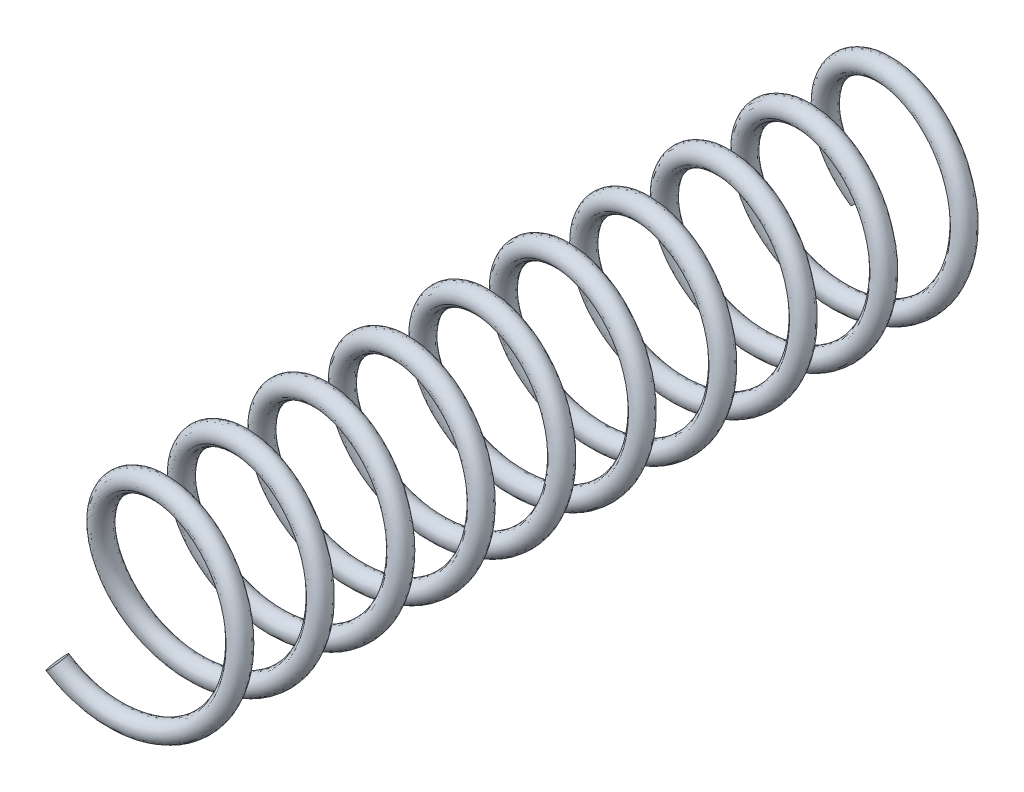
from build123d import *

# Parameters (mm, degrees)
SWEEP2_PITCH       = 10
SWEEP2_HEIGHT      = 100
SWEEP2_RADIUS      = 11
SWEEP2_START_ANGLE = -135
SWEEP2_PROFILE_R   = 1.25


with BuildPart() as part:
    # Sweep2: sweep along a helix
    with BuildLine() as sweep2_path:
        add(Helix(SWEEP2_PITCH, SWEEP2_HEIGHT, SWEEP2_RADIUS, center=(0, 0, 0), direction=(0, 0, 1), lefthand=True, mode=Mode.PRIVATE).rotate(Axis((0, 0, 0), (0, 0, 1)), SWEEP2_START_ANGLE))
    # Sweep2 profile (on start of the path) → Sweep2 (sweep)
    with BuildSketch(Plane(origin=(-7.778174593, -7.778174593, 0), x_dir=(0.707106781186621, 0.7071067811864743, 0), z_dir=(-0.6998196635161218, 0.6998196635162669, 0.143195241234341))):
        Circle(SWEEP2_PROFILE_R)
    sweep(path=sweep2_path.line, is_frenet=True)


solid = part.part
